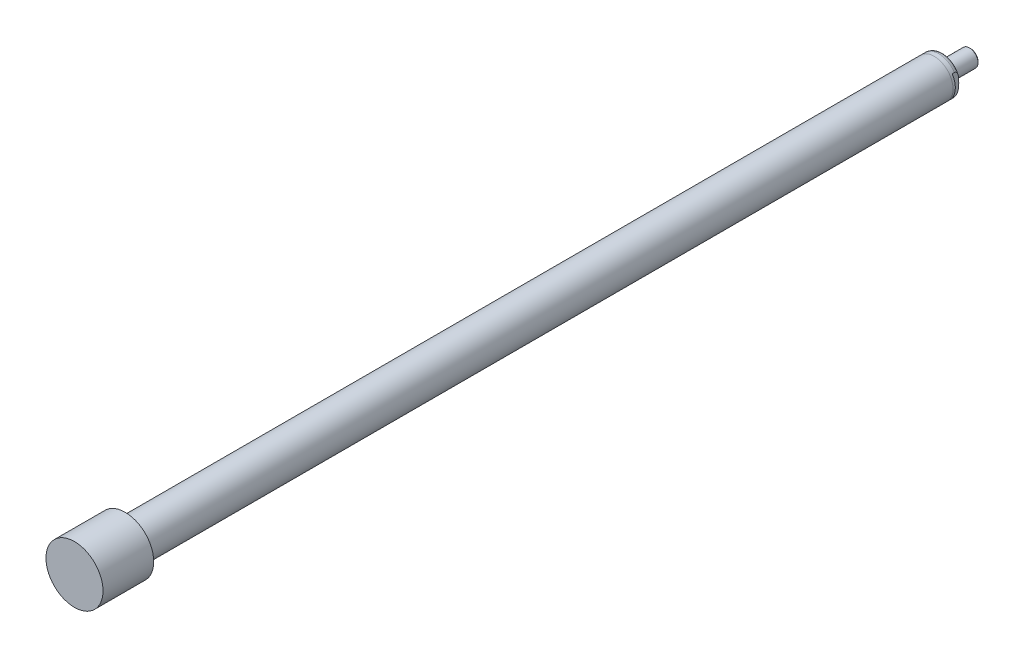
ISO-10303-21;
HEADER;
FILE_DESCRIPTION(('STEP AP214'),'2;1');
FILE_NAME('part.step','',(''),(''),'','','');
FILE_SCHEMA(('AUTOMOTIVE_DESIGN { 1 0 10303 214 1 1 1 1 }'));
ENDSEC;
DATA;
#1=APPLICATION_CONTEXT('core data for automotive mechanical design processes');
#2=APPLICATION_PROTOCOL_DEFINITION('international standard','automotive_design',2000,#1);
#3=PRODUCT_CONTEXT('',#1,'mechanical');
#4=PRODUCT('Part','Part','',(#3));
#5=PRODUCT_RELATED_PRODUCT_CATEGORY('part','',(#4));
#6=PRODUCT_DEFINITION_FORMATION('','',#4);
#7=PRODUCT_DEFINITION_CONTEXT('part definition',#1,'design');
#8=PRODUCT_DEFINITION('design','',#6,#7);
#9=PRODUCT_DEFINITION_SHAPE('','',#8);
#10=(LENGTH_UNIT() NAMED_UNIT(*) SI_UNIT(.MILLI.,.METRE.));
#11=(NAMED_UNIT(*) PLANE_ANGLE_UNIT() SI_UNIT($,.RADIAN.));
#12=(NAMED_UNIT(*) SI_UNIT($,.STERADIAN.) SOLID_ANGLE_UNIT());
#13=UNCERTAINTY_MEASURE_WITH_UNIT(LENGTH_MEASURE(1.E-05),#10,'distance_accuracy_value','');
#14=(GEOMETRIC_REPRESENTATION_CONTEXT(3) GLOBAL_UNCERTAINTY_ASSIGNED_CONTEXT((#13)) GLOBAL_UNIT_ASSIGNED_CONTEXT((#10,
#11,#12)) REPRESENTATION_CONTEXT('',''));
#15=CARTESIAN_POINT('',(0.,0.,0.));
#16=DIRECTION('',(0.,0.,1.));
#17=DIRECTION('',(1.,0.,0.));
#18=AXIS2_PLACEMENT_3D('',#15,#16,#17);
#19=CARTESIAN_POINT('',(0.,0.,38.608));
#20=DIRECTION('',(0.,0.,1.));
#21=DIRECTION('',(1.,0.,0.));
#22=AXIS2_PLACEMENT_3D('',#19,#20,#21);
#23=PLANE('',#22);
#24=CARTESIAN_POINT('',(0.,0.,38.608));
#25=DIRECTION('',(0.,0.,1.));
#26=DIRECTION('',(1.,0.,0.));
#27=AXIS2_PLACEMENT_3D('',#24,#25,#26);
#28=CIRCLE('',#27,19.939);
#29=CARTESIAN_POINT('',(19.939,0.,38.608));
#30=VERTEX_POINT('',#29);
#31=EDGE_CURVE('E337',#30,#30,#28,.T.);
#32=ORIENTED_EDGE('',*,*,#31,.T.);
#33=EDGE_LOOP('',(#32));
#34=FACE_BOUND('',#33,.T.);
#35=ADVANCED_FACE('F16',(#34),#23,.T.);
#36=CARTESIAN_POINT('',(0.,0.,0.126999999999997));
#37=DIRECTION('',(0.,0.,1.));
#38=DIRECTION('',(1.,0.,0.));
#39=AXIS2_PLACEMENT_3D('',#36,#37,#38);
#40=CYLINDRICAL_SURFACE('',#39,19.939);
#41=ORIENTED_EDGE('',*,*,#31,.F.);
#42=EDGE_LOOP('',(#41));
#43=FACE_BOUND('',#42,.T.);
#44=CARTESIAN_POINT('',(0.,0.,3.175));
#45=DIRECTION('',(0.,0.,-1.));
#46=DIRECTION('',(-1.,0.,0.));
#47=AXIS2_PLACEMENT_3D('',#44,#45,#46);
#48=CIRCLE('',#47,19.939);
#49=CARTESIAN_POINT('',(-19.939,0.,3.175));
#50=VERTEX_POINT('',#49);
#51=EDGE_CURVE('E338',#50,#50,#48,.T.);
#52=ORIENTED_EDGE('',*,*,#51,.F.);
#53=EDGE_LOOP('',(#52));
#54=FACE_BOUND('',#53,.T.);
#55=ADVANCED_FACE('F286',(#43,#54),#40,.T.);
#56=CARTESIAN_POINT('',(0.,0.,3.175));
#57=DIRECTION('',(0.,0.,-1.));
#58=DIRECTION('',(-1.,0.,0.));
#59=AXIS2_PLACEMENT_3D('',#56,#57,#58);
#60=PLANE('',#59);
#61=CARTESIAN_POINT('',(0.,0.,3.175));
#62=DIRECTION('',(0.,0.,-1.));
#63=DIRECTION('',(-1.,0.,0.));
#64=AXIS2_PLACEMENT_3D('',#61,#62,#63);
#65=CIRCLE('',#64,13.2);
#66=CARTESIAN_POINT('',(-13.2,0.,3.175));
#67=VERTEX_POINT('',#66);
#68=EDGE_CURVE('E83',#67,#67,#65,.F.);
#69=ORIENTED_EDGE('',*,*,#68,.T.);
#70=EDGE_LOOP('',(#69));
#71=FACE_BOUND('',#70,.T.);
#72=ORIENTED_EDGE('',*,*,#51,.T.);
#73=EDGE_LOOP('',(#72));
#74=FACE_BOUND('',#73,.T.);
#75=ADVANCED_FACE('F276',(#71,#74),#60,.T.);
#76=CARTESIAN_POINT('',(0.,0.,12.7));
#77=DIRECTION('',(0.,0.,-1.));
#78=DIRECTION('',(-1.,0.,0.));
#79=AXIS2_PLACEMENT_3D('',#76,#77,#78);
#80=CYLINDRICAL_SURFACE('',#79,13.2);
#81=ORIENTED_EDGE('',*,*,#68,.F.);
#82=EDGE_LOOP('',(#81));
#83=FACE_BOUND('',#82,.T.);
#84=CARTESIAN_POINT('',(0.,0.,-562.16020000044));
#85=DIRECTION('',(0.,0.,1.));
#86=DIRECTION('',(1.,0.,0.));
#87=AXIS2_PLACEMENT_3D('',#84,#85,#86);
#88=CIRCLE('',#87,13.2);
#89=CARTESIAN_POINT('',(13.2,0.,-562.16020000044));
#90=VERTEX_POINT('',#89);
#91=EDGE_CURVE('E20',#90,#90,#88,.T.);
#92=ORIENTED_EDGE('',*,*,#91,.T.);
#93=EDGE_LOOP('',(#92));
#94=FACE_BOUND('',#93,.T.);
#95=ADVANCED_FACE('F18',(#83,#94),#80,.T.);
#96=CARTESIAN_POINT('',(0.,0.,-562.16020000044));
#97=DIRECTION('',(0.,0.,1.));
#98=DIRECTION('',(1.,0.,0.));
#99=AXIS2_PLACEMENT_3D('',#96,#97,#98);
#100=PLANE('',#99);
#101=CARTESIAN_POINT('',(0.,0.,-562.16020000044));
#102=DIRECTION('',(0.,0.,-1.));
#103=DIRECTION('',(-1.,0.,0.));
#104=AXIS2_PLACEMENT_3D('',#101,#102,#103);
#105=CIRCLE('',#104,13.1953);
#106=CARTESIAN_POINT('',(-13.1953,0.,-562.16020000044));
#107=VERTEX_POINT('',#106);
#108=EDGE_CURVE('E102',#107,#107,#105,.T.);
#109=ORIENTED_EDGE('',*,*,#108,.F.);
#110=EDGE_LOOP('',(#109));
#111=FACE_BOUND('',#110,.T.);
#112=ORIENTED_EDGE('',*,*,#91,.F.);
#113=EDGE_LOOP('',(#112));
#114=FACE_BOUND('',#113,.T.);
#115=ADVANCED_FACE('F135',(#111,#114),#100,.F.);
#116=CARTESIAN_POINT('',(0.,6.,-587.56020000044));
#117=DIRECTION('',(0.,0.,-1.));
#118=DIRECTION('',(-1.,0.,0.));
#119=AXIS2_PLACEMENT_3D('',#116,#117,#118);
#120=PLANE('',#119);
#121=CARTESIAN_POINT('',(0.,0.,-587.56020000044));
#122=DIRECTION('',(0.,0.,-1.));
#123=DIRECTION('',(-1.,0.,0.));
#124=AXIS2_PLACEMENT_3D('',#121,#122,#123);
#125=CIRCLE('',#124,5.238);
#126=CARTESIAN_POINT('',(-5.238,0.,-587.56020000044));
#127=VERTEX_POINT('',#126);
#128=EDGE_CURVE('E105',#127,#127,#125,.T.);
#129=ORIENTED_EDGE('',*,*,#128,.T.);
#130=EDGE_LOOP('',(#129));
#131=FACE_BOUND('',#130,.T.);
#132=ADVANCED_FACE('F131',(#131),#120,.T.);
#133=CARTESIAN_POINT('',(0.,0.,-587.56020000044));
#134=DIRECTION('',(0.,0.,1.));
#135=DIRECTION('',(1.,0.,0.));
#136=AXIS2_PLACEMENT_3D('',#133,#134,#135);
#137=CONICAL_SURFACE('',#136,5.238,0.785398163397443);
#138=CARTESIAN_POINT('',(0.,0.,-586.79820000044));
#139=DIRECTION('',(0.,0.,-1.));
#140=DIRECTION('',(-1.,0.,0.));
#141=AXIS2_PLACEMENT_3D('',#138,#139,#140);
#142=CIRCLE('',#141,6.);
#143=CARTESIAN_POINT('',(-6.,0.,-586.79820000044));
#144=VERTEX_POINT('',#143);
#145=EDGE_CURVE('E108',#144,#144,#142,.F.);
#146=ORIENTED_EDGE('',*,*,#145,.F.);
#147=EDGE_LOOP('',(#146));
#148=FACE_BOUND('',#147,.T.);
#149=ORIENTED_EDGE('',*,*,#128,.F.);
#150=EDGE_LOOP('',(#149));
#151=FACE_BOUND('',#150,.T.);
#152=ADVANCED_FACE('F134',(#148,#151),#137,.T.);
#153=CARTESIAN_POINT('',(0.,0.,-587.56020000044));
#154=DIRECTION('',(0.,0.,-1.));
#155=DIRECTION('',(-1.,0.,0.));
#156=AXIS2_PLACEMENT_3D('',#153,#154,#155);
#157=CYLINDRICAL_SURFACE('',#156,6.);
#158=ORIENTED_EDGE('',*,*,#145,.T.);
#159=EDGE_LOOP('',(#158));
#160=FACE_BOUND('',#159,.T.);
#161=CARTESIAN_POINT('',(0.,0.,-571.30420000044));
#162=DIRECTION('',(0.,0.,-1.));
#163=DIRECTION('',(-1.,0.,0.));
#164=AXIS2_PLACEMENT_3D('',#161,#162,#163);
#165=CIRCLE('',#164,6.);
#166=CARTESIAN_POINT('',(-6.,0.,-571.30420000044));
#167=VERTEX_POINT('',#166);
#168=EDGE_CURVE('E77',#167,#167,#165,.T.);
#169=ORIENTED_EDGE('',*,*,#168,.T.);
#170=EDGE_LOOP('',(#169));
#171=FACE_BOUND('',#170,.T.);
#172=ADVANCED_FACE('F137',(#160,#171),#157,.T.);
#173=CARTESIAN_POINT('',(0.,4.6736,-571.30420000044));
#174=DIRECTION('',(0.,0.,1.));
#175=DIRECTION('',(1.,0.,0.));
#176=AXIS2_PLACEMENT_3D('',#173,#174,#175);
#177=PLANE('',#176);
#178=CARTESIAN_POINT('',(0.,0.,-571.30420000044));
#179=DIRECTION('',(0.,0.,-1.));
#180=DIRECTION('',(-1.,0.,0.));
#181=AXIS2_PLACEMENT_3D('',#178,#179,#180);
#182=CIRCLE('',#181,4.6736);
#183=CARTESIAN_POINT('',(-4.6736,0.,-571.30420000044));
#184=VERTEX_POINT('',#183);
#185=EDGE_CURVE('E90',#184,#184,#182,.T.);
#186=ORIENTED_EDGE('',*,*,#185,.T.);
#187=EDGE_LOOP('',(#186));
#188=FACE_BOUND('',#187,.T.);
#189=ORIENTED_EDGE('',*,*,#168,.F.);
#190=EDGE_LOOP('',(#189));
#191=FACE_BOUND('',#190,.T.);
#192=ADVANCED_FACE('F140',(#188,#191),#177,.T.);
#193=CARTESIAN_POINT('',(0.,0.,-587.56020000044));
#194=DIRECTION('',(0.,0.,-1.));
#195=DIRECTION('',(-1.,0.,0.));
#196=AXIS2_PLACEMENT_3D('',#193,#194,#195);
#197=CYLINDRICAL_SURFACE('',#196,4.6736);
#198=CARTESIAN_POINT('',(0.,0.,-568.51020000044));
#199=DIRECTION('',(0.,0.,-1.));
#200=DIRECTION('',(-1.,0.,0.));
#201=AXIS2_PLACEMENT_3D('',#198,#199,#200);
#202=CIRCLE('',#201,4.6736);
#203=CARTESIAN_POINT('',(-4.6736,0.,-568.51020000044));
#204=VERTEX_POINT('',#203);
#205=EDGE_CURVE('E93',#204,#204,#202,.T.);
#206=ORIENTED_EDGE('',*,*,#205,.T.);
#207=EDGE_LOOP('',(#206));
#208=FACE_BOUND('',#207,.T.);
#209=ORIENTED_EDGE('',*,*,#185,.F.);
#210=EDGE_LOOP('',(#209));
#211=FACE_BOUND('',#210,.T.);
#212=ADVANCED_FACE('F144',(#208,#211),#197,.T.);
#213=CARTESIAN_POINT('',(0.,10.0203,-568.51020000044));
#214=DIRECTION('',(0.,0.,-1.));
#215=DIRECTION('',(-1.,0.,0.));
#216=AXIS2_PLACEMENT_3D('',#213,#214,#215);
#217=PLANE('',#216);
#218=CARTESIAN_POINT('',(0.,0.,-568.51020000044));
#219=DIRECTION('',(0.,0.,-1.));
#220=DIRECTION('',(-1.,0.,0.));
#221=AXIS2_PLACEMENT_3D('',#218,#219,#220);
#222=CIRCLE('',#221,10.0203);
#223=CARTESIAN_POINT('',(-10.0203,0.,-568.51020000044));
#224=VERTEX_POINT('',#223);
#225=EDGE_CURVE('E96',#224,#224,#222,.T.);
#226=ORIENTED_EDGE('',*,*,#225,.T.);
#227=EDGE_LOOP('',(#226));
#228=FACE_BOUND('',#227,.T.);
#229=ORIENTED_EDGE('',*,*,#205,.F.);
#230=EDGE_LOOP('',(#229));
#231=FACE_BOUND('',#230,.T.);
#232=ADVANCED_FACE('F147',(#228,#231),#217,.T.);
#233=CARTESIAN_POINT('',(0.,0.,-563.74770000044));
#234=DIRECTION('',(0.,0.,-1.));
#235=DIRECTION('',(0.,1.,0.));
#236=AXIS2_PLACEMENT_3D('',#233,#234,#235);
#237=PLANE('',#236);
#238=CARTESIAN_POINT('',(0.,0.,-563.74770000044));
#239=DIRECTION('',(0.,0.,-1.));
#240=DIRECTION('',(0.,1.,0.));
#241=AXIS2_PLACEMENT_3D('',#238,#239,#240);
#242=CIRCLE('',#241,13.1953);
#243=CARTESIAN_POINT('',(11.,7.28806847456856,-563.74770000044));
#244=VERTEX_POINT('',#243);
#245=CARTESIAN_POINT('',(11.,-7.28806847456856,-563.74770000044));
#246=VERTEX_POINT('',#245);
#247=EDGE_CURVE('E60',#244,#246,#242,.T.);
#248=ORIENTED_EDGE('',*,*,#247,.T.);
#249=DIRECTION('',(0.,1.,0.));
#250=VECTOR('',#249,1.);
#251=CARTESIAN_POINT('',(11.,-7.28806847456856,-563.74770000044));
#252=LINE('',#251,#250);
#253=EDGE_CURVE('E62',#246,#244,#252,.T.);
#254=ORIENTED_EDGE('',*,*,#253,.T.);
#255=EDGE_LOOP('',(#248,#254));
#256=FACE_BOUND('',#255,.T.);
#257=ADVANCED_FACE('F61',(#256),#237,.T.);
#258=CARTESIAN_POINT('',(0.,0.,-563.74770000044));
#259=DIRECTION('',(0.,0.,-1.));
#260=DIRECTION('',(0.,1.,0.));
#261=AXIS2_PLACEMENT_3D('',#258,#259,#260);
#262=PLANE('',#261);
#263=CARTESIAN_POINT('',(0.,0.,-563.74770000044));
#264=DIRECTION('',(0.,0.,-1.));
#265=DIRECTION('',(0.,1.,0.));
#266=AXIS2_PLACEMENT_3D('',#263,#264,#265);
#267=CIRCLE('',#266,13.1953);
#268=CARTESIAN_POINT('',(-11.,-7.28806847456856,-563.74770000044));
#269=VERTEX_POINT('',#268);
#270=CARTESIAN_POINT('',(-11.,7.28806847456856,-563.74770000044));
#271=VERTEX_POINT('',#270);
#272=EDGE_CURVE('E80',#269,#271,#267,.T.);
#273=ORIENTED_EDGE('',*,*,#272,.T.);
#274=DIRECTION('',(0.,-1.,0.));
#275=VECTOR('',#274,1.);
#276=CARTESIAN_POINT('',(-11.,-7.28806847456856,-563.74770000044));
#277=LINE('',#276,#275);
#278=EDGE_CURVE('E82',#271,#269,#277,.T.);
#279=ORIENTED_EDGE('',*,*,#278,.T.);
#280=EDGE_LOOP('',(#273,#279));
#281=FACE_BOUND('',#280,.T.);
#282=ADVANCED_FACE('F130',(#281),#262,.T.);
#283=CARTESIAN_POINT('',(-11.,-7.28806847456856,-563.74770000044));
#284=DIRECTION('',(1.,0.,0.));
#285=DIRECTION('',(0.,0.,-1.));
#286=AXIS2_PLACEMENT_3D('',#283,#284,#285);
#287=PLANE('',#286);
#288=CARTESIAN_POINT('',(-11.,0.,-568.355268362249));
#289=CARTESIAN_POINT('',(-11.,-0.283999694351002,-568.355276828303));
#290=CARTESIAN_POINT('',(-11.,-0.568005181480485,-568.351762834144));
#291=CARTESIAN_POINT('',(-11.,-1.13588950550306,-568.337002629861));
#292=CARTESIAN_POINT('',(-11.,-1.41976830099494,-568.325754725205));
#293=CARTESIAN_POINT('',(-11.,-1.98660637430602,-568.293360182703));
#294=CARTESIAN_POINT('',(-11.,-2.26956637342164,-568.272226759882));
#295=CARTESIAN_POINT('',(-11.,-2.83413520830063,-568.216455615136));
#296=CARTESIAN_POINT('',(-11.,-3.11574456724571,-568.181823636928));
#297=CARTESIAN_POINT('',(-11.,-3.55465920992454,-568.112884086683));
#298=CARTESIAN_POINT('',(-11.,-3.71295758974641,-568.084937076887));
#299=CARTESIAN_POINT('',(-11.,-4.02809043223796,-568.021800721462));
#300=CARTESIAN_POINT('',(-11.,-4.18492521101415,-567.98661297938));
#301=CARTESIAN_POINT('',(-11.,-4.49637441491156,-567.907602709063));
#302=CARTESIAN_POINT('',(-11.,-4.6509896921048,-567.863783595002));
#303=CARTESIAN_POINT('',(-11.,-4.95689533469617,-567.765873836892));
#304=CARTESIAN_POINT('',(-11.,-5.10818706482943,-567.711787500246));
#305=CARTESIAN_POINT('',(-11.,-5.45074925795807,-567.57333993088));
#306=CARTESIAN_POINT('',(-11.,-5.64036341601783,-567.484765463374));
#307=CARTESIAN_POINT('',(-11.,-6.00572300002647,-567.282289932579));
#308=CARTESIAN_POINT('',(-11.,-6.1814901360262,-567.168429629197));
#309=CARTESIAN_POINT('',(-11.,-6.45820918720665,-566.951091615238));
#310=CARTESIAN_POINT('',(-11.,-6.56534232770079,-566.855546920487));
#311=CARTESIAN_POINT('',(-11.,-6.76389982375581,-566.649235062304));
#312=CARTESIAN_POINT('',(-11.,-6.85534714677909,-566.538490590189));
#313=CARTESIAN_POINT('',(-11.,-6.99925203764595,-566.327429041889));
#314=CARTESIAN_POINT('',(-11.,-7.05586542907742,-566.229964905));
#315=CARTESIAN_POINT('',(-11.,-7.15237368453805,-566.027019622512));
#316=CARTESIAN_POINT('',(-11.,-7.19227985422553,-565.921543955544));
#317=CARTESIAN_POINT('',(-11.,-7.25258182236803,-565.704218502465));
#318=CARTESIAN_POINT('',(-11.,-7.27283171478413,-565.592327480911));
#319=CARTESIAN_POINT('',(-11.,-7.29141605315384,-565.366741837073));
#320=CARTESIAN_POINT('',(-11.,-7.28976069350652,-565.253048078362));
#321=CARTESIAN_POINT('',(-11.,-7.26620536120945,-565.041238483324));
#322=CARTESIAN_POINT('',(-11.,-7.246679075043,-564.942847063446));
#323=CARTESIAN_POINT('',(-11.,-7.19210149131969,-564.750513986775));
#324=CARTESIAN_POINT('',(-11.,-7.15704664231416,-564.656573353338));
#325=CARTESIAN_POINT('',(-11.,-7.06159341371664,-564.449045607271));
#326=CARTESIAN_POINT('',(-11.,-6.996821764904,-564.337475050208));
#327=CARTESIAN_POINT('',(-11.,-6.84998946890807,-564.126353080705));
#328=CARTESIAN_POINT('',(-11.,-6.76789440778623,-564.0268262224));
#329=CARTESIAN_POINT('',(-11.,-6.551460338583,-563.798525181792));
#330=CARTESIAN_POINT('',(-11.,-6.41012375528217,-563.676427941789));
#331=CARTESIAN_POINT('',(-11.,-6.1105685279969,-563.455585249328));
#332=CARTESIAN_POINT('',(-11.,-5.95232925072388,-563.356868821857));
#333=CARTESIAN_POINT('',(-11.,-5.64572522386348,-563.190416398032));
#334=CARTESIAN_POINT('',(-11.,-5.49859707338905,-563.120350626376));
#335=CARTESIAN_POINT('',(-11.,-5.19879419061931,-562.993116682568));
#336=CARTESIAN_POINT('',(-11.,-5.04611483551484,-562.935959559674));
#337=CARTESIAN_POINT('',(-11.,-4.73651269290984,-562.832366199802));
#338=CARTESIAN_POINT('',(-11.,-4.57957488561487,-562.785975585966));
#339=CARTESIAN_POINT('',(-11.,-4.26338013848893,-562.702457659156));
#340=CARTESIAN_POINT('',(-11.,-4.10412450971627,-562.665325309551));
#341=CARTESIAN_POINT('',(-11.,-3.80528382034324,-562.603184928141));
#342=CARTESIAN_POINT('',(-11.,-3.66589375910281,-562.577221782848));
#343=CARTESIAN_POINT('',(-11.,-3.38627572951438,-562.530241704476));
#344=CARTESIAN_POINT('',(-11.,-3.24604766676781,-562.509225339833));
#345=CARTESIAN_POINT('',(-11.,-2.82435930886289,-562.452438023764));
#346=CARTESIAN_POINT('',(-11.,-2.54205294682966,-562.422959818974));
#347=CARTESIAN_POINT('',(-11.,-1.97560851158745,-562.376021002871));
#348=CARTESIAN_POINT('',(-11.,-1.6914674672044,-562.358599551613));
#349=CARTESIAN_POINT('',(-11.,-1.1228812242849,-562.332792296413));
#350=CARTESIAN_POINT('',(-11.,-0.838436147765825,-562.324403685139));
#351=CARTESIAN_POINT('',(-11.,-0.268305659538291,-562.314955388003));
#352=CARTESIAN_POINT('',(-11.,0.0173801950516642,-562.313924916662));
#353=CARTESIAN_POINT('',(-11.,0.588744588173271,-562.319052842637));
#354=CARTESIAN_POINT('',(-11.,0.874423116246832,-562.325212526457));
#355=CARTESIAN_POINT('',(-11.,1.44479398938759,-562.345965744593));
#356=CARTESIAN_POINT('',(-11.,1.72948704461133,-562.360538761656));
#357=CARTESIAN_POINT('',(-11.,2.29804894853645,-562.400819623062));
#358=CARTESIAN_POINT('',(-11.,2.58191804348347,-562.426523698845));
#359=CARTESIAN_POINT('',(-11.,3.0694765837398,-562.484089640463));
#360=CARTESIAN_POINT('',(-11.,3.27359191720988,-562.512272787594));
#361=CARTESIAN_POINT('',(-11.,3.68030619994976,-562.578886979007));
#362=CARTESIAN_POINT('',(-11.,3.88290424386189,-562.617323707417));
#363=CARTESIAN_POINT('',(-11.,4.28378522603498,-562.706764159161));
#364=CARTESIAN_POINT('',(-11.,4.48208907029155,-562.757672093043));
#365=CARTESIAN_POINT('',(-11.,4.87385387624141,-562.87534497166));
#366=CARTESIAN_POINT('',(-11.,5.0673194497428,-562.942094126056));
#367=CARTESIAN_POINT('',(-11.,5.42309726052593,-563.085885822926));
#368=CARTESIAN_POINT('',(-11.,5.58631452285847,-563.160652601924));
#369=CARTESIAN_POINT('',(-11.,5.90375766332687,-563.328613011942));
#370=CARTESIAN_POINT('',(-11.,6.05795849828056,-563.421855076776));
#371=CARTESIAN_POINT('',(-11.,6.35347249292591,-563.631180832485));
#372=CARTESIAN_POINT('',(-11.,6.4945843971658,-563.747554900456));
#373=CARTESIAN_POINT('',(-11.,6.75236292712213,-564.00472070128));
#374=CARTESIAN_POINT('',(-11.,6.86913495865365,-564.145402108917));
#375=CARTESIAN_POINT('',(-11.,7.026859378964,-564.389523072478));
#376=CARTESIAN_POINT('',(-11.,7.07947573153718,-564.485434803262));
#377=CARTESIAN_POINT('',(-11.,7.16853265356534,-564.684564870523));
#378=CARTESIAN_POINT('',(-11.,7.20498337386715,-564.787778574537));
#379=CARTESIAN_POINT('',(-11.,7.2592011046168,-564.999792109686));
#380=CARTESIAN_POINT('',(-11.,7.27684597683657,-565.108623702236));
#381=CARTESIAN_POINT('',(-11.,7.29147337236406,-565.327665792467));
#382=CARTESIAN_POINT('',(-11.,7.28846304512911,-565.437875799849));
#383=CARTESIAN_POINT('',(-11.,7.26329711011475,-565.645810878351));
#384=CARTESIAN_POINT('',(-11.,7.2429127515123,-565.74375784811));
#385=CARTESIAN_POINT('',(-11.,7.18679789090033,-565.935114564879));
#386=CARTESIAN_POINT('',(-11.,7.15106215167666,-566.028522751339));
#387=CARTESIAN_POINT('',(-11.,7.05375831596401,-566.235877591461));
#388=CARTESIAN_POINT('',(-11.,6.98767220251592,-566.347699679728));
#389=CARTESIAN_POINT('',(-11.,6.8382191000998,-566.559096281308));
#390=CARTESIAN_POINT('',(-11.,6.75482099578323,-566.65864822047));
#391=CARTESIAN_POINT('',(-11.,6.53478721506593,-566.88732461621));
#392=CARTESIAN_POINT('',(-11.,6.39108122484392,-567.009601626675));
#393=CARTESIAN_POINT('',(-11.,6.08671299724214,-567.230560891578));
#394=CARTESIAN_POINT('',(-11.,5.92601813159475,-567.32919650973));
#395=CARTESIAN_POINT('',(-11.,5.61399295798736,-567.495750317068));
#396=CARTESIAN_POINT('',(-11.,5.46384379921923,-567.565932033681));
#397=CARTESIAN_POINT('',(-11.,5.15800379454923,-567.693138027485));
#398=CARTESIAN_POINT('',(-11.,5.00230841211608,-567.750151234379));
#399=CARTESIAN_POINT('',(-11.,4.68703415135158,-567.853164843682));
#400=CARTESIAN_POINT('',(-11.,4.52744819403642,-567.899143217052));
#401=CARTESIAN_POINT('',(-11.,4.20585528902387,-567.981793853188));
#402=CARTESIAN_POINT('',(-11.,4.04384743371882,-568.018462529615));
#403=CARTESIAN_POINT('',(-11.,3.72194157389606,-568.083303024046));
#404=CARTESIAN_POINT('',(-11.,3.56207763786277,-568.111646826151));
#405=CARTESIAN_POINT('',(-11.,3.24141366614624,-568.162154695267));
#406=CARTESIAN_POINT('',(-11.,3.08061376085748,-568.184319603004));
#407=CARTESIAN_POINT('',(-11.,2.75826796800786,-568.223536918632));
#408=CARTESIAN_POINT('',(-11.,2.59672157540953,-568.240585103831));
#409=CARTESIAN_POINT('',(-11.,2.27322894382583,-568.270415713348));
#410=CARTESIAN_POINT('',(-11.,2.11128267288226,-568.283197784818));
#411=CARTESIAN_POINT('',(-11.,1.78700791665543,-568.305207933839));
#412=CARTESIAN_POINT('',(-11.,1.62467921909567,-568.314432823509));
#413=CARTESIAN_POINT('',(-11.,1.29988702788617,-568.329857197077));
#414=CARTESIAN_POINT('',(-11.,1.1374235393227,-568.336056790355));
#415=CARTESIAN_POINT('',(-11.,0.812483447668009,-568.345819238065));
#416=CARTESIAN_POINT('',(-11.,0.650006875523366,-568.349383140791));
#417=CARTESIAN_POINT('',(-11.,0.325020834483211,-568.354105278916));
#418=CARTESIAN_POINT('',(-11.,0.162511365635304,-568.355263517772));
#419=CARTESIAN_POINT('',(-11.,0.,-568.355268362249));
#420=B_SPLINE_CURVE_WITH_KNOTS('',3,(#288,#289,#290,#291,#292,#293,#294,#295,#296,#297,#298,
#299,#300,#301,#302,#303,#304,#305,#306,#307,#308,#309,#310,#311,#312,#313,#314,#315,#316,#317,
#318,#319,#320,#321,#322,#323,#324,#325,#326,#327,#328,#329,#330,#331,#332,#333,#334,#335,#336,
#337,#338,#339,#340,#341,#342,#343,#344,#345,#346,#347,#348,#349,#350,#351,#352,#353,#354,#355,
#356,#357,#358,#359,#360,#361,#362,#363,#364,#365,#366,#367,#368,#369,#370,#371,#372,#373,#374,
#375,#376,#377,#378,#379,#380,#381,#382,#383,#384,#385,#386,#387,#388,#389,#390,#391,#392,#393,
#394,#395,#396,#397,#398,#399,#400,#401,#402,#403,#404,#405,#406,#407,#408,#409,#410,#411,#412,
#413,#414,#415,#416,#417,#418,#419),.UNSPECIFIED.,.T.,.F.,(4,2,2,2,2,2,2,2,2,2,2,2,2,2,2,2,2,2,
2,2,2,2,2,2,2,2,2,2,2,2,2,2,2,2,2,2,2,2,2,2,2,2,2,2,2,2,2,2,2,2,2,2,2,2,2,2,2,2,2,2,2,2,2,2,2,
4),(0.,0.851985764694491,1.70415826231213,2.55519481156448,3.4058696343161,3.88797536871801,
4.36997444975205,4.851783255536,5.33339037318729,5.95979821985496,6.5852035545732,
7.01456982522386,7.44330194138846,7.78013770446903,8.11674516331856,8.45583253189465,
8.79476209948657,9.09432594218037,9.39395833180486,9.77885740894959,10.164528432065,
10.7217137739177,11.2795872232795,11.7677560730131,12.256341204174,12.7469603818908,
13.2373120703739,13.6625744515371,14.0878856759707,14.9389905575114,15.7928469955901,
16.6464379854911,17.5034161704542,18.3605477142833,19.2155977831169,20.0703585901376,
20.688318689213,21.3066220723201,21.9203175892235,22.5334039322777,23.0710845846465,
23.6101938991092,24.1565548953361,24.7004982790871,25.0274756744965,25.3542474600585,
25.683128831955,26.0118963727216,26.3106776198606,26.6095608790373,26.9970844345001,
27.3853106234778,27.9482115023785,28.5122138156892,29.008712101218,29.505626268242,
30.0035243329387,30.5016139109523,30.9885424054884,31.4754046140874,31.9626675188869,
32.4499707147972,32.9377096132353,33.4254308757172,33.9129580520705,34.4004845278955),.UNSPECIFIED.);
#421=CARTESIAN_POINT('',(-11.,7.28806847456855,-565.33520000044));
#422=VERTEX_POINT('',#421);
#423=CARTESIAN_POINT('',(-11.,-7.28806847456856,-565.335200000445));
#424=VERTEX_POINT('',#423);
#425=EDGE_CURVE('E25',#422,#424,#420,.T.);
#426=ORIENTED_EDGE('',*,*,#425,.T.);
#427=DIRECTION('',(0.,0.,-1.));
#428=VECTOR('',#427,1.);
#429=CARTESIAN_POINT('',(-11.,-7.28806847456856,-563.74770000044));
#430=LINE('',#429,#428);
#431=EDGE_CURVE('E65',#269,#424,#430,.T.);
#432=ORIENTED_EDGE('',*,*,#431,.F.);
#433=ORIENTED_EDGE('',*,*,#278,.F.);
#434=DIRECTION('',(0.,0.,-1.));
#435=VECTOR('',#434,1.);
#436=CARTESIAN_POINT('',(-11.,7.28806847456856,-563.74770000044));
#437=LINE('',#436,#435);
#438=EDGE_CURVE('E40',#271,#422,#437,.T.);
#439=ORIENTED_EDGE('',*,*,#438,.T.);
#440=EDGE_LOOP('',(#426,#432,#433,#439));
#441=FACE_BOUND('',#440,.T.);
#442=ADVANCED_FACE('F125',(#441),#287,.F.);
#443=CARTESIAN_POINT('',(0.,0.,-565.33520000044));
#444=DIRECTION('',(0.,0.,-1.));
#445=DIRECTION('',(-1.,0.,0.));
#446=AXIS2_PLACEMENT_3D('',#443,#444,#445);
#447=TOROIDAL_SURFACE('',#446,10.0203,3.175);
#448=CARTESIAN_POINT('',(11.,0.,-568.355268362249));
#449=CARTESIAN_POINT('',(11.,0.283999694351,-568.355276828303));
#450=CARTESIAN_POINT('',(11.,0.568005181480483,-568.351762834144));
#451=CARTESIAN_POINT('',(11.,1.13588950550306,-568.337002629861));
#452=CARTESIAN_POINT('',(11.,1.41976830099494,-568.325754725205));
#453=CARTESIAN_POINT('',(11.,1.98660637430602,-568.293360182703));
#454=CARTESIAN_POINT('',(11.,2.26956637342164,-568.272226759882));
#455=CARTESIAN_POINT('',(11.,2.83413520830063,-568.216455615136));
#456=CARTESIAN_POINT('',(11.,3.11574456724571,-568.181823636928));
#457=CARTESIAN_POINT('',(11.,3.55465920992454,-568.112884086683));
#458=CARTESIAN_POINT('',(11.,3.71295758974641,-568.084937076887));
#459=CARTESIAN_POINT('',(11.,4.02809043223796,-568.021800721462));
#460=CARTESIAN_POINT('',(11.,4.18492521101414,-567.98661297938));
#461=CARTESIAN_POINT('',(11.,4.49637441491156,-567.907602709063));
#462=CARTESIAN_POINT('',(11.,4.6509896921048,-567.863783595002));
#463=CARTESIAN_POINT('',(11.,4.95689533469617,-567.765873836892));
#464=CARTESIAN_POINT('',(11.,5.10818706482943,-567.711787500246));
#465=CARTESIAN_POINT('',(11.,5.45074925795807,-567.57333993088));
#466=CARTESIAN_POINT('',(11.,5.64036341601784,-567.484765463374));
#467=CARTESIAN_POINT('',(11.,6.00572300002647,-567.282289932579));
#468=CARTESIAN_POINT('',(11.,6.1814901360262,-567.168429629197));
#469=CARTESIAN_POINT('',(11.,6.45820918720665,-566.951091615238));
#470=CARTESIAN_POINT('',(11.,6.56534232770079,-566.855546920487));
#471=CARTESIAN_POINT('',(11.,6.76389982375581,-566.649235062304));
#472=CARTESIAN_POINT('',(11.,6.85534714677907,-566.538490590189));
#473=CARTESIAN_POINT('',(11.,6.99925203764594,-566.327429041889));
#474=CARTESIAN_POINT('',(11.,7.05586542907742,-566.229964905));
#475=CARTESIAN_POINT('',(11.,7.15237368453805,-566.027019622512));
#476=CARTESIAN_POINT('',(11.,7.19227985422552,-565.921543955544));
#477=CARTESIAN_POINT('',(11.,7.252581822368,-565.704218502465));
#478=CARTESIAN_POINT('',(11.,7.2728317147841,-565.592327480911));
#479=CARTESIAN_POINT('',(11.,7.29141605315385,-565.366741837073));
#480=CARTESIAN_POINT('',(11.,7.28976069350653,-565.253048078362));
#481=CARTESIAN_POINT('',(11.,7.26620536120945,-565.041238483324));
#482=CARTESIAN_POINT('',(11.,7.24667907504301,-564.942847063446));
#483=CARTESIAN_POINT('',(11.,7.19210149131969,-564.750513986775));
#484=CARTESIAN_POINT('',(11.,7.15704664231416,-564.656573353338));
#485=CARTESIAN_POINT('',(11.,7.06159341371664,-564.449045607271));
#486=CARTESIAN_POINT('',(11.,6.996821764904,-564.337475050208));
#487=CARTESIAN_POINT('',(11.,6.84998946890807,-564.126353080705));
#488=CARTESIAN_POINT('',(11.,6.76789440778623,-564.0268262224));
#489=CARTESIAN_POINT('',(11.,6.551460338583,-563.798525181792));
#490=CARTESIAN_POINT('',(11.,6.41012375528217,-563.676427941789));
#491=CARTESIAN_POINT('',(11.,6.1105685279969,-563.455585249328));
#492=CARTESIAN_POINT('',(11.,5.95232925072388,-563.356868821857));
#493=CARTESIAN_POINT('',(11.,5.64572522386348,-563.190416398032));
#494=CARTESIAN_POINT('',(11.,5.49859707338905,-563.120350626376));
#495=CARTESIAN_POINT('',(11.,5.19879419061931,-562.993116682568));
#496=CARTESIAN_POINT('',(11.,5.04611483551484,-562.935959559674));
#497=CARTESIAN_POINT('',(11.,4.73651269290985,-562.832366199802));
#498=CARTESIAN_POINT('',(11.,4.57957488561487,-562.785975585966));
#499=CARTESIAN_POINT('',(11.,4.26338013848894,-562.702457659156));
#500=CARTESIAN_POINT('',(11.,4.10412450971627,-562.665325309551));
#501=CARTESIAN_POINT('',(11.,3.80528382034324,-562.603184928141));
#502=CARTESIAN_POINT('',(11.,3.66589375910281,-562.577221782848));
#503=CARTESIAN_POINT('',(11.,3.38627572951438,-562.530241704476));
#504=CARTESIAN_POINT('',(11.,3.24604766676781,-562.509225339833));
#505=CARTESIAN_POINT('',(11.,2.82435930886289,-562.452438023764));
#506=CARTESIAN_POINT('',(11.,2.54205294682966,-562.422959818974));
#507=CARTESIAN_POINT('',(11.,1.97560851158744,-562.376021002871));
#508=CARTESIAN_POINT('',(11.,1.69146746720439,-562.358599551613));
#509=CARTESIAN_POINT('',(11.,1.1228812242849,-562.332792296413));
#510=CARTESIAN_POINT('',(11.,0.838436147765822,-562.324403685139));
#511=CARTESIAN_POINT('',(11.,0.268305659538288,-562.314955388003));
#512=CARTESIAN_POINT('',(11.,-0.0173801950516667,-562.313924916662));
#513=CARTESIAN_POINT('',(11.,-0.588744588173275,-562.319052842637));
#514=CARTESIAN_POINT('',(11.,-0.874423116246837,-562.325212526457));
#515=CARTESIAN_POINT('',(11.,-1.4447939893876,-562.345965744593));
#516=CARTESIAN_POINT('',(11.,-1.72948704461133,-562.360538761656));
#517=CARTESIAN_POINT('',(11.,-2.29804894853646,-562.400819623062));
#518=CARTESIAN_POINT('',(11.,-2.58191804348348,-562.426523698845));
#519=CARTESIAN_POINT('',(11.,-3.06947658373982,-562.484089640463));
#520=CARTESIAN_POINT('',(11.,-3.27359191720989,-562.512272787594));
#521=CARTESIAN_POINT('',(11.,-3.68030619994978,-562.578886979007));
#522=CARTESIAN_POINT('',(11.,-3.88290424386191,-562.617323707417));
#523=CARTESIAN_POINT('',(11.,-4.283785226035,-562.706764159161));
#524=CARTESIAN_POINT('',(11.,-4.48208907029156,-562.757672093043));
#525=CARTESIAN_POINT('',(11.,-4.87385387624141,-562.87534497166));
#526=CARTESIAN_POINT('',(11.,-5.0673194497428,-562.942094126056));
#527=CARTESIAN_POINT('',(11.,-5.42309726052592,-563.085885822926));
#528=CARTESIAN_POINT('',(11.,-5.58631452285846,-563.160652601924));
#529=CARTESIAN_POINT('',(11.,-5.90375766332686,-563.328613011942));
#530=CARTESIAN_POINT('',(11.,-6.05795849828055,-563.421855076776));
#531=CARTESIAN_POINT('',(11.,-6.3534724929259,-563.631180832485));
#532=CARTESIAN_POINT('',(11.,-6.4945843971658,-563.747554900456));
#533=CARTESIAN_POINT('',(11.,-6.75236292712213,-564.00472070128));
#534=CARTESIAN_POINT('',(11.,-6.86913495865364,-564.145402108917));
#535=CARTESIAN_POINT('',(11.,-7.02685937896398,-564.389523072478));
#536=CARTESIAN_POINT('',(11.,-7.07947573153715,-564.485434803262));
#537=CARTESIAN_POINT('',(11.,-7.16853265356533,-564.684564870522));
#538=CARTESIAN_POINT('',(11.,-7.20498337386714,-564.787778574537));
#539=CARTESIAN_POINT('',(11.,-7.2592011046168,-564.999792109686));
#540=CARTESIAN_POINT('',(11.,-7.27684597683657,-565.108623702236));
#541=CARTESIAN_POINT('',(11.,-7.29147337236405,-565.327665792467));
#542=CARTESIAN_POINT('',(11.,-7.2884630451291,-565.437875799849));
#543=CARTESIAN_POINT('',(11.,-7.26329711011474,-565.645810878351));
#544=CARTESIAN_POINT('',(11.,-7.2429127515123,-565.74375784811));
#545=CARTESIAN_POINT('',(11.,-7.18679789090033,-565.935114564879));
#546=CARTESIAN_POINT('',(11.,-7.15106215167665,-566.028522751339));
#547=CARTESIAN_POINT('',(11.,-7.05375831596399,-566.235877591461));
#548=CARTESIAN_POINT('',(11.,-6.98767220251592,-566.347699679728));
#549=CARTESIAN_POINT('',(11.,-6.83821910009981,-566.559096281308));
#550=CARTESIAN_POINT('',(11.,-6.75482099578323,-566.65864822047));
#551=CARTESIAN_POINT('',(11.,-6.53478721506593,-566.88732461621));
#552=CARTESIAN_POINT('',(11.,-6.39108122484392,-567.009601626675));
#553=CARTESIAN_POINT('',(11.,-6.08671299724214,-567.230560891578));
#554=CARTESIAN_POINT('',(11.,-5.92601813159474,-567.32919650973));
#555=CARTESIAN_POINT('',(11.,-5.61399295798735,-567.495750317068));
#556=CARTESIAN_POINT('',(11.,-5.46384379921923,-567.565932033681));
#557=CARTESIAN_POINT('',(11.,-5.15800379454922,-567.693138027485));
#558=CARTESIAN_POINT('',(11.,-5.00230841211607,-567.750151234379));
#559=CARTESIAN_POINT('',(11.,-4.68703415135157,-567.853164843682));
#560=CARTESIAN_POINT('',(11.,-4.52744819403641,-567.899143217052));
#561=CARTESIAN_POINT('',(11.,-4.20585528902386,-567.981793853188));
#562=CARTESIAN_POINT('',(11.,-4.0438474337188,-568.018462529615));
#563=CARTESIAN_POINT('',(11.,-3.72194157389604,-568.083303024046));
#564=CARTESIAN_POINT('',(11.,-3.56207763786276,-568.111646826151));
#565=CARTESIAN_POINT('',(11.,-3.24141366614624,-568.162154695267));
#566=CARTESIAN_POINT('',(11.,-3.08061376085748,-568.184319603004));
#567=CARTESIAN_POINT('',(11.,-2.75826796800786,-568.223536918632));
#568=CARTESIAN_POINT('',(11.,-2.59672157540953,-568.240585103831));
#569=CARTESIAN_POINT('',(11.,-2.27322894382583,-568.270415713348));
#570=CARTESIAN_POINT('',(11.,-2.11128267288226,-568.283197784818));
#571=CARTESIAN_POINT('',(11.,-1.78700791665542,-568.305207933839));
#572=CARTESIAN_POINT('',(11.,-1.62467921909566,-568.314432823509));
#573=CARTESIAN_POINT('',(11.,-1.29988702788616,-568.329857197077));
#574=CARTESIAN_POINT('',(11.,-1.13742353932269,-568.336056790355));
#575=CARTESIAN_POINT('',(11.,-0.812483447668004,-568.345819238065));
#576=CARTESIAN_POINT('',(11.,-0.650006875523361,-568.349383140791));
#577=CARTESIAN_POINT('',(11.,-0.325020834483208,-568.354105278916));
#578=CARTESIAN_POINT('',(11.,-0.162511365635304,-568.355263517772));
#579=CARTESIAN_POINT('',(11.,0.,-568.355268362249));
#580=B_SPLINE_CURVE_WITH_KNOTS('',3,(#448,#449,#450,#451,#452,#453,#454,#455,#456,#457,#458,
#459,#460,#461,#462,#463,#464,#465,#466,#467,#468,#469,#470,#471,#472,#473,#474,#475,#476,#477,
#478,#479,#480,#481,#482,#483,#484,#485,#486,#487,#488,#489,#490,#491,#492,#493,#494,#495,#496,
#497,#498,#499,#500,#501,#502,#503,#504,#505,#506,#507,#508,#509,#510,#511,#512,#513,#514,#515,
#516,#517,#518,#519,#520,#521,#522,#523,#524,#525,#526,#527,#528,#529,#530,#531,#532,#533,#534,
#535,#536,#537,#538,#539,#540,#541,#542,#543,#544,#545,#546,#547,#548,#549,#550,#551,#552,#553,
#554,#555,#556,#557,#558,#559,#560,#561,#562,#563,#564,#565,#566,#567,#568,#569,#570,#571,#572,
#573,#574,#575,#576,#577,#578,#579),.UNSPECIFIED.,.T.,.F.,(4,2,2,2,2,2,2,2,2,2,2,2,2,2,2,2,2,2,
2,2,2,2,2,2,2,2,2,2,2,2,2,2,2,2,2,2,2,2,2,2,2,2,2,2,2,2,2,2,2,2,2,2,2,2,2,2,2,2,2,2,2,2,2,2,2,
4),(0.,0.851985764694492,1.70415826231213,2.55519481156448,3.40586963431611,3.88797536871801,
4.36997444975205,4.851783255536,5.33339037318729,5.95979821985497,6.58520355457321,
7.01456982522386,7.44330194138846,7.78013770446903,8.11674516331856,8.45583253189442,
8.79476209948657,9.09432594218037,9.39395833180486,9.77885740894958,10.164528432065,
10.7217137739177,11.2795872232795,11.7677560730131,12.256341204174,12.7469603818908,
13.2373120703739,13.6625744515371,14.0878856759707,14.9389905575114,15.7928469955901,
16.6464379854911,17.5034161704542,18.3605477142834,19.2155977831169,20.0703585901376,
20.688318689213,21.3066220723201,21.9203175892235,22.5334039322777,23.0710845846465,
23.6101938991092,24.1565548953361,24.700498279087,25.0274756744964,25.3542474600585,
25.683128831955,26.0118963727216,26.3106776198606,26.6095608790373,26.9970844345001,
27.3853106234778,27.9482115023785,28.5122138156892,29.008712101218,29.5056262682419,
30.0035243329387,30.5016139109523,30.9885424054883,31.4754046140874,31.9626675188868,
32.4499707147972,32.9377096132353,33.4254308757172,33.9129580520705,34.4004845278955),.UNSPECIFIED.);
#581=CARTESIAN_POINT('',(11.,-7.28806847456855,-565.33520000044));
#582=VERTEX_POINT('',#581);
#583=CARTESIAN_POINT('',(11.,7.28806847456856,-565.335200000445));
#584=VERTEX_POINT('',#583);
#585=EDGE_CURVE('E10',#582,#584,#580,.T.);
#586=ORIENTED_EDGE('',*,*,#585,.F.);
#587=CARTESIAN_POINT('',(0.,0.,-565.33520000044));
#588=DIRECTION('',(0.,0.,-1.));
#589=DIRECTION('',(-1.,0.,0.));
#590=AXIS2_PLACEMENT_3D('',#587,#588,#589);
#591=CIRCLE('',#590,13.1953);
#592=EDGE_CURVE('E75',#582,#424,#591,.T.);
#593=ORIENTED_EDGE('',*,*,#592,.T.);
#594=ORIENTED_EDGE('',*,*,#425,.F.);
#595=EDGE_CURVE('E99',#422,#584,#591,.T.);
#596=ORIENTED_EDGE('',*,*,#595,.T.);
#597=EDGE_LOOP('',(#586,#593,#594,#596));
#598=FACE_BOUND('',#597,.T.);
#599=ORIENTED_EDGE('',*,*,#225,.F.);
#600=EDGE_LOOP('',(#599));
#601=FACE_BOUND('',#600,.T.);
#602=ADVANCED_FACE('F121',(#598,#601),#447,.T.);
#603=CARTESIAN_POINT('',(11.,-7.28806847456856,-563.74770000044));
#604=DIRECTION('',(-1.,0.,0.));
#605=DIRECTION('',(0.,-1.,0.));
#606=AXIS2_PLACEMENT_3D('',#603,#604,#605);
#607=PLANE('',#606);
#608=ORIENTED_EDGE('',*,*,#585,.T.);
#609=DIRECTION('',(0.,0.,-1.));
#610=VECTOR('',#609,1.);
#611=CARTESIAN_POINT('',(11.,7.28806847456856,-563.74770000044));
#612=LINE('',#611,#610);
#613=EDGE_CURVE('E68',#244,#584,#612,.T.);
#614=ORIENTED_EDGE('',*,*,#613,.F.);
#615=ORIENTED_EDGE('',*,*,#253,.F.);
#616=DIRECTION('',(0.,0.,-1.));
#617=VECTOR('',#616,1.);
#618=CARTESIAN_POINT('',(11.,-7.28806847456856,-563.74770000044));
#619=LINE('',#618,#617);
#620=EDGE_CURVE('E32',#246,#582,#619,.T.);
#621=ORIENTED_EDGE('',*,*,#620,.T.);
#622=EDGE_LOOP('',(#608,#614,#615,#621));
#623=FACE_BOUND('',#622,.T.);
#624=ADVANCED_FACE('F67',(#623),#607,.F.);
#625=CARTESIAN_POINT('',(0.,0.,-587.56020000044));
#626=DIRECTION('',(0.,0.,-1.));
#627=DIRECTION('',(-1.,0.,0.));
#628=AXIS2_PLACEMENT_3D('',#625,#626,#627);
#629=CYLINDRICAL_SURFACE('',#628,13.1953);
#630=ORIENTED_EDGE('',*,*,#613,.T.);
#631=ORIENTED_EDGE('',*,*,#595,.F.);
#632=ORIENTED_EDGE('',*,*,#438,.F.);
#633=ORIENTED_EDGE('',*,*,#272,.F.);
#634=ORIENTED_EDGE('',*,*,#431,.T.);
#635=ORIENTED_EDGE('',*,*,#592,.F.);
#636=ORIENTED_EDGE('',*,*,#620,.F.);
#637=ORIENTED_EDGE('',*,*,#247,.F.);
#638=EDGE_LOOP('',(#630,#631,#632,#633,#634,#635,#636,#637));
#639=FACE_BOUND('',#638,.T.);
#640=ORIENTED_EDGE('',*,*,#108,.T.);
#641=EDGE_LOOP('',(#640));
#642=FACE_BOUND('',#641,.T.);
#643=ADVANCED_FACE('F71',(#639,#642),#629,.T.);
#644=CLOSED_SHELL('',(#35,#55,#75,#95,#115,#132,#152,#172,#192,#212,#232,#257,#282,#442,#602,
#624,#643));
#645=MANIFOLD_SOLID_BREP('B1',#644);
#646=ADVANCED_BREP_SHAPE_REPRESENTATION('',(#18,#645),#14);
#647=SHAPE_DEFINITION_REPRESENTATION(#9,#646);
ENDSEC;
END-ISO-10303-21;
